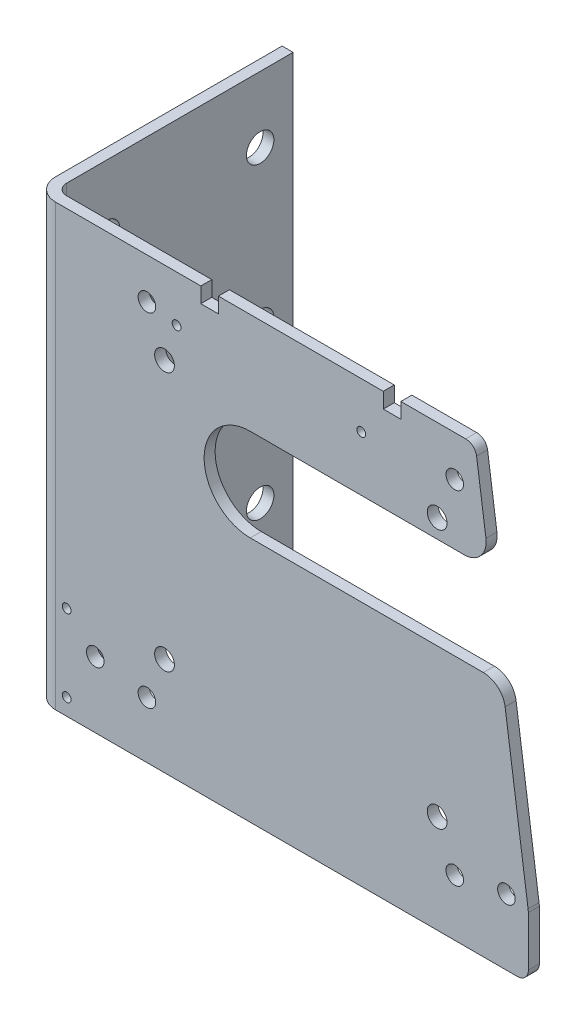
from build123d import *

# Parameters (mm, degrees)
ESQUISSE1_R                     = 4.5
ESQUISSE1_R_2                   = 4
EXTRUSION1_DEPTH                = 5
TROU_TARAUD_M4X0_71_D           = 3.3
TROU_TARAUD_M4X0_71_DEPTH       = 10.1
TROU_TARAUD_M4X0_71_CBORE_D     = 4
TROU_TARAUD_M4X0_71_CBORE_DEPTH = 8
TROU_TARAUD_M4X0_71_TIP         = 0.991420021
ESQUISSE3_W                     = 5
ESQUISSE3_H                     = 200
EXTRUSION2_DEPTH                = 113
CONG_1_R                        = 10
CONG_2_R                        = 5
ESQUISSE4_R                     = 6.25
ENL_V_MAT_EXTRU_1_DEPTH         = 271.218604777


with BuildPart() as part:
    # Esquisse1 → Extrusion1 (new body)
    with BuildSketch(Plane.XY):
        with BuildLine():
            Line((-121.5, 96.4), (-121.5, -103.6))
            Line((-121.5, -103.6), (98.491409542, -103.6))
            ThreePointArc((98.491409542, -103.6), (102.029976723, -102.132498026), (103.491402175, -98.591416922))
            Line((103.491402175, -98.591416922), (103.452525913, -75.944411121))
            ThreePointArc((103.452525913, -75.944411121), (103.42757875, -75.255450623), (103.355221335, -74.569846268))
            Line((103.355221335, -74.569846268), (92.904383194, -0.20826899))
            ThreePointArc((92.904383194, -0.20826899), (89.562292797, 5.947095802), (83.001702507, 8.4))
            Line((83.001702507, 8.4), (-22.994, 8.4))
            ThreePointArc((-22.994, 8.4), (-43.994, 29.4), (-22.994, 50.4))
            Line((-22.994, 50.4), (74.288170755, 50.4))
            ThreePointArc((74.288170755, 50.4), (81.835266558, 53.83940971), (84.190851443, 61.79173101))
            Line((84.190851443, 61.79173101), (79.931883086, 92.095865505))
            ThreePointArc((79.931883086, 92.095865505), (78.260837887, 95.173547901), (74.980542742, 96.4))
            Line((74.980542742, 96.4), (45.5, 96.4))
            Line((45.5, 96.4), (45.5, 89.4))
            Line((45.5, 89.4), (37.5, 89.4))
            Line((37.5, 89.4), (37.5, 96.4))
            Line((37.5, 96.4), (-37.5, 96.4))
            Line((-37.5, 96.4), (-37.5, 89.4))
            Line((-37.5, 89.4), (-45.5, 89.4))
            Line((-45.5, 89.4), (-45.5, 96.4))
            Line((-45.5, 96.4), (-121.5, 96.4))
        make_face()
        with Locations((-62, -58.9)):
            Circle(ESQUISSE1_R, mode=Mode.SUBTRACT)
        with Locations((62, -58.9)):
            Circle(ESQUISSE1_R, mode=Mode.SUBTRACT)
        with Locations((62, 58.9)):
            Circle(ESQUISSE1_R, mode=Mode.SUBTRACT)
        with Locations((-62, 58.9)):
            Circle(ESQUISSE1_R, mode=Mode.SUBTRACT)
        with Locations((-70, 77.9)):
            Circle(ESQUISSE1_R_2, mode=Mode.SUBTRACT)
        with Locations((70, 77.9)):
            Circle(ESQUISSE1_R_2, mode=Mode.SUBTRACT)
        with Locations((93.5, -73.6)):
            Circle(ESQUISSE1_R_2, mode=Mode.SUBTRACT)
        with Locations((70, -77.9)):
            Circle(ESQUISSE1_R_2, mode=Mode.SUBTRACT)
        with Locations((-70, -77.9)):
            Circle(ESQUISSE1_R_2, mode=Mode.SUBTRACT)
        with Locations((-93.5, -73.6)):
            Circle(ESQUISSE1_R_2, mode=Mode.SUBTRACT)
    extrude(amount=EXTRUSION1_DEPTH)

    # Trou taraud_ M4x0.71
    with Locations(Plane(origin=(-56.5, 75.4, 5), x_dir=(1, 0, 0), z_dir=(0, 0, 1))):
        with Locations((0, 0), (84, 0), (-50, -136.5), (-50, -171.5)):
            CounterBoreHole(TROU_TARAUD_M4X0_71_D / 2, TROU_TARAUD_M4X0_71_CBORE_D / 2, TROU_TARAUD_M4X0_71_CBORE_DEPTH, depth=TROU_TARAUD_M4X0_71_DEPTH)
            with Locations((0, 0, -(TROU_TARAUD_M4X0_71_DEPTH + TROU_TARAUD_M4X0_71_TIP / 2))):  # 118° drill point
                Cone(0, TROU_TARAUD_M4X0_71_D / 2, TROU_TARAUD_M4X0_71_TIP, mode=Mode.SUBTRACT)

    # Esquisse3 → Extrusion2 (add)
    with BuildSketch(Plane.XY.offset(5)):
        with Locations((-119, -3.6)):
            Rectangle(ESQUISSE3_W, ESQUISSE3_H)
    extrude(amount=-EXTRUSION2_DEPTH)

    # Cong_1
    cong_1_edges = [part.edges().sort_by_distance(p)[0] for p in [
        (-121.5, -3.6, 5),
    ]]
    fillet(cong_1_edges, radius=CONG_1_R)

    # Cong_2
    cong_2_edges = [part.edges().sort_by_distance(p)[0] for p in [
        (-116.5, -3.6, 0),
    ]]
    fillet(cong_2_edges, radius=CONG_2_R)

    # Esquisse4 → Enl_v. mat.-Extru.1 (cut, through all)
    with BuildSketch(Plane.ZY.offset(121.5)):
        with Locations(Location((-93, -73.6, 0), (0, 0, 270))):
            Circle(ESQUISSE4_R)
        with Locations(Location((-93, -3.6, 0), (0, 0, 270))):
            Circle(ESQUISSE4_R)
        with Locations(Location((-93, 66.4, 0), (0, 0, 270))):
            Circle(ESQUISSE4_R)
        with Locations(Location((-23, -3.6, 0), (0, 0, 270))):
            Circle(ESQUISSE4_R)
        with Locations(Location((-23, -73.6, 0), (0, 0, 270))):
            Circle(ESQUISSE4_R)
        with Locations(Location((-23, 66.4, 0), (0, 0, 270))):
            Circle(ESQUISSE4_R)
    extrude(amount=-ENL_V_MAT_EXTRU_1_DEPTH, mode=Mode.SUBTRACT)


solid = part.part
